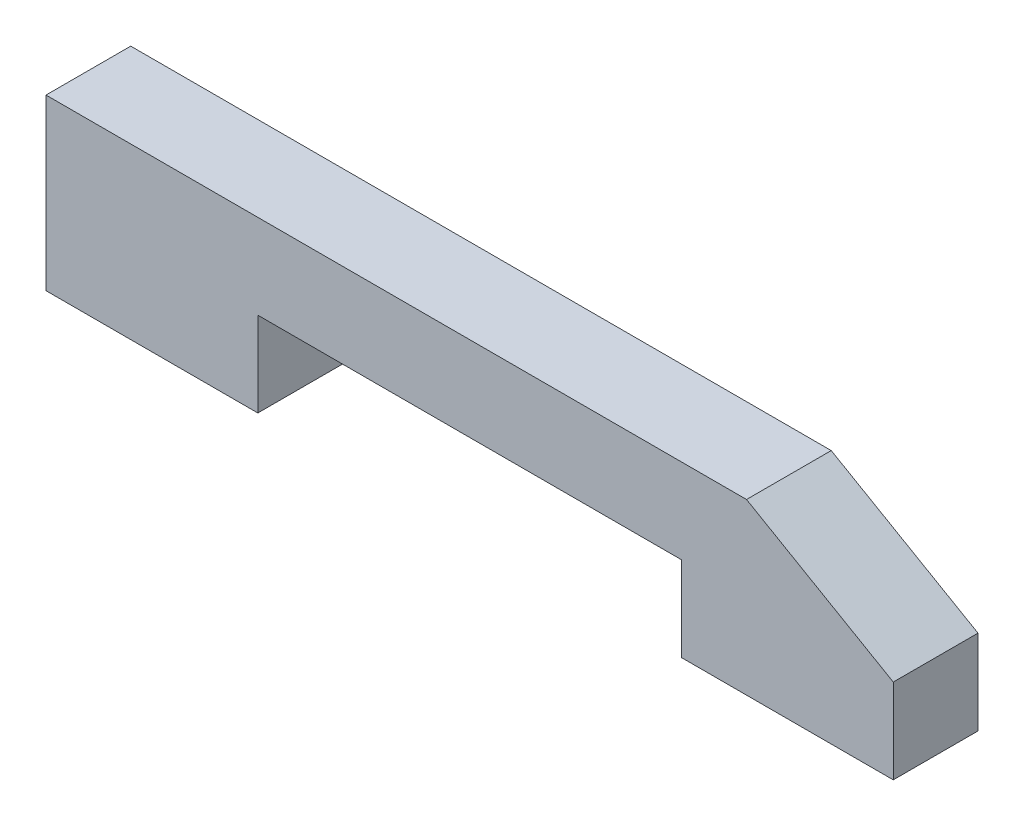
from build123d import *

# Parameters (mm, degrees)
BOSS_EXTRU_1_DEPTH = 3
CHANFREIN1_SIZE    = 3
CHANFREIN1_SIZE2   = 5.196152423


with BuildPart() as part:
    # Esquisse1 → Boss.-Extru.1 (new body)
    with BuildSketch(Plane.XY):
        Polygon((0, 0), (0, 6), (30, 6), (30, 0), (22.5, 0), (22.5, 3), (7.5, 3), (7.5, 0), align=None)
    extrude(amount=BOSS_EXTRU_1_DEPTH)

    # Chanfrein1
    chanfrein1_edges = [part.edges().sort_by_distance(p)[0] for p in [
        (30, 6, 1.5),
    ]]
    chanfrein1_side = [part.faces().sort_by_distance(p)[0] for p in [
        (30, 3, 1.5),
    ]]
    chamfer(chanfrein1_edges, length=CHANFREIN1_SIZE, length2=CHANFREIN1_SIZE2, reference=chanfrein1_side[0])


solid = part.part
